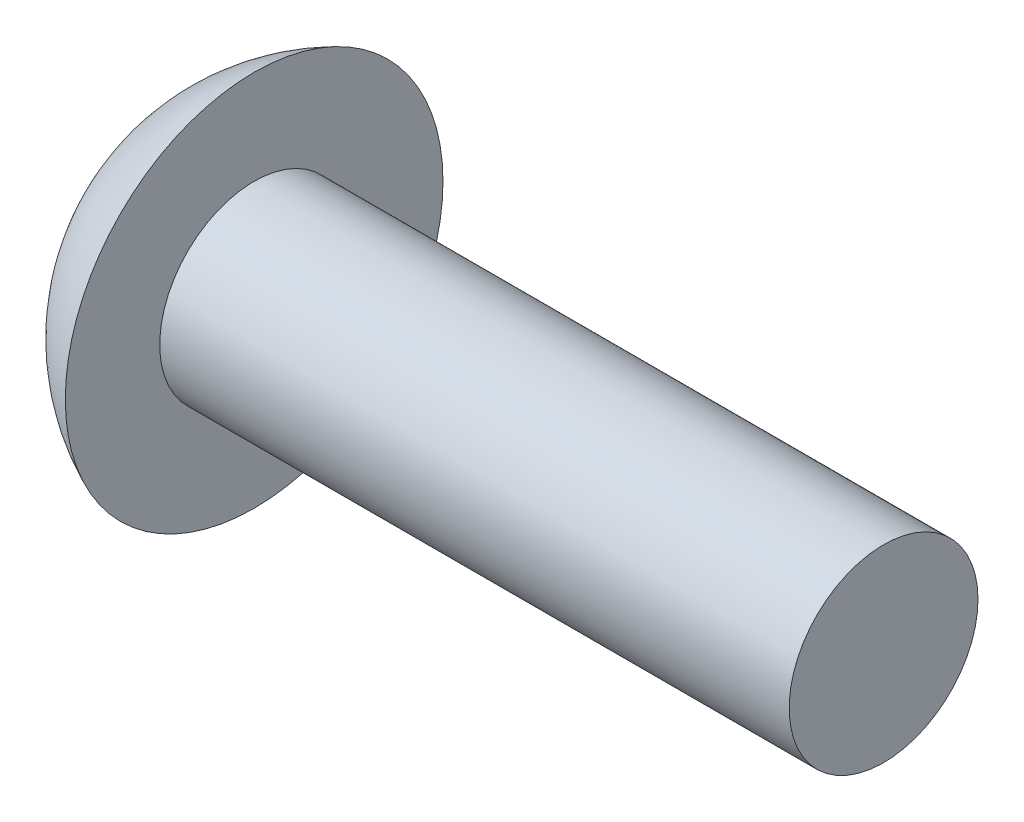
ISO-10303-21;
HEADER;
FILE_DESCRIPTION(('STEP AP214'),'2;1');
FILE_NAME('part.step','',(''),(''),'','','');
FILE_SCHEMA(('AUTOMOTIVE_DESIGN { 1 0 10303 214 1 1 1 1 }'));
ENDSEC;
DATA;
#1=APPLICATION_CONTEXT('core data for automotive mechanical design processes');
#2=APPLICATION_PROTOCOL_DEFINITION('international standard','automotive_design',2000,#1);
#3=PRODUCT_CONTEXT('',#1,'mechanical');
#4=PRODUCT('Part','Part','',(#3));
#5=PRODUCT_RELATED_PRODUCT_CATEGORY('part','',(#4));
#6=PRODUCT_DEFINITION_FORMATION('','',#4);
#7=PRODUCT_DEFINITION_CONTEXT('part definition',#1,'design');
#8=PRODUCT_DEFINITION('design','',#6,#7);
#9=PRODUCT_DEFINITION_SHAPE('','',#8);
#10=(LENGTH_UNIT() NAMED_UNIT(*) SI_UNIT(.MILLI.,.METRE.));
#11=(NAMED_UNIT(*) PLANE_ANGLE_UNIT() SI_UNIT($,.RADIAN.));
#12=(NAMED_UNIT(*) SI_UNIT($,.STERADIAN.) SOLID_ANGLE_UNIT());
#13=UNCERTAINTY_MEASURE_WITH_UNIT(LENGTH_MEASURE(1.E-05),#10,'distance_accuracy_value','');
#14=(GEOMETRIC_REPRESENTATION_CONTEXT(3) GLOBAL_UNCERTAINTY_ASSIGNED_CONTEXT((#13)) GLOBAL_UNIT_ASSIGNED_CONTEXT((#10,
#11,#12)) REPRESENTATION_CONTEXT('',''));
#15=CARTESIAN_POINT('',(0.,0.,0.));
#16=DIRECTION('',(0.,0.,1.));
#17=DIRECTION('',(1.,0.,0.));
#18=AXIS2_PLACEMENT_3D('',#15,#16,#17);
#19=CARTESIAN_POINT('',(0.,0.,0.));
#20=DIRECTION('',(1.,0.,0.));
#21=DIRECTION('',(0.,0.,-1.));
#22=AXIS2_PLACEMENT_3D('',#19,#20,#21);
#23=PLANE('',#22);
#24=CARTESIAN_POINT('',(0.,0.,0.));
#25=DIRECTION('',(-1.,0.,0.));
#26=DIRECTION('',(0.,0.,1.));
#27=AXIS2_PLACEMENT_3D('',#24,#25,#26);
#28=CIRCLE('',#27,2.75);
#29=CARTESIAN_POINT('',(0.,2.75,0.));
#30=VERTEX_POINT('',#29);
#31=EDGE_CURVE('E132',#30,#30,#28,.T.);
#32=ORIENTED_EDGE('',*,*,#31,.T.);
#33=EDGE_LOOP('',(#32));
#34=FACE_BOUND('',#33,.T.);
#35=DIRECTION('',(0.,0.866025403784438,-0.5));
#36=VECTOR('',#35,1.);
#37=CARTESIAN_POINT('',(0.,-2.,-1.15470053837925));
#38=LINE('',#37,#36);
#39=CARTESIAN_POINT('',(0.,-2.,-1.15470053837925));
#40=VERTEX_POINT('',#39);
#41=CARTESIAN_POINT('',(0.,0.,-2.3094010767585));
#42=VERTEX_POINT('',#41);
#43=EDGE_CURVE('E60',#40,#42,#38,.T.);
#44=ORIENTED_EDGE('',*,*,#43,.T.);
#45=DIRECTION('',(0.,0.866025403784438,0.5));
#46=VECTOR('',#45,1.);
#47=CARTESIAN_POINT('',(0.,0.,-2.3094010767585));
#48=LINE('',#47,#46);
#49=CARTESIAN_POINT('',(0.,2.,-1.15470053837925));
#50=VERTEX_POINT('',#49);
#51=EDGE_CURVE('E116',#42,#50,#48,.T.);
#52=ORIENTED_EDGE('',*,*,#51,.T.);
#53=DIRECTION('',(0.,0.,1.));
#54=VECTOR('',#53,1.);
#55=CARTESIAN_POINT('',(0.,2.,-1.15470053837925));
#56=LINE('',#55,#54);
#57=CARTESIAN_POINT('',(0.,2.,1.15470053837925));
#58=VERTEX_POINT('',#57);
#59=EDGE_CURVE('E112',#50,#58,#56,.T.);
#60=ORIENTED_EDGE('',*,*,#59,.T.);
#61=DIRECTION('',(0.,-0.866025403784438,0.5));
#62=VECTOR('',#61,1.);
#63=CARTESIAN_POINT('',(0.,2.,1.15470053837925));
#64=LINE('',#63,#62);
#65=CARTESIAN_POINT('',(0.,0.,2.3094010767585));
#66=VERTEX_POINT('',#65);
#67=EDGE_CURVE('E93',#58,#66,#64,.T.);
#68=ORIENTED_EDGE('',*,*,#67,.T.);
#69=DIRECTION('',(0.,-0.866025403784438,-0.5));
#70=VECTOR('',#69,1.);
#71=CARTESIAN_POINT('',(0.,0.,2.3094010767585));
#72=LINE('',#71,#70);
#73=CARTESIAN_POINT('',(0.,-2.,1.15470053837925));
#74=VERTEX_POINT('',#73);
#75=EDGE_CURVE('E104',#66,#74,#72,.T.);
#76=ORIENTED_EDGE('',*,*,#75,.T.);
#77=DIRECTION('',(0.,0.,-1.));
#78=VECTOR('',#77,1.);
#79=CARTESIAN_POINT('',(0.,-2.,1.15470053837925));
#80=LINE('',#79,#78);
#81=EDGE_CURVE('E109',#74,#40,#80,.T.);
#82=ORIENTED_EDGE('',*,*,#81,.T.);
#83=EDGE_LOOP('',(#44,#52,#60,#68,#76,#82));
#84=FACE_BOUND('',#83,.T.);
#85=ADVANCED_FACE('F43',(#34,#84),#23,.F.);
#86=CARTESIAN_POINT('',(3.3,0.,0.));
#87=DIRECTION('',(1.,0.,0.));
#88=DIRECTION('',(0.,0.,-1.));
#89=AXIS2_PLACEMENT_3D('',#86,#87,#88);
#90=PLANE('',#89);
#91=CARTESIAN_POINT('',(3.3,0.,0.));
#92=DIRECTION('',(-1.,0.,0.));
#93=DIRECTION('',(0.,0.,1.));
#94=AXIS2_PLACEMENT_3D('',#91,#92,#93);
#95=CIRCLE('',#94,6.);
#96=CARTESIAN_POINT('',(3.3,6.,0.));
#97=VERTEX_POINT('',#96);
#98=EDGE_CURVE('E131',#97,#97,#95,.T.);
#99=ORIENTED_EDGE('',*,*,#98,.F.);
#100=EDGE_LOOP('',(#99));
#101=FACE_BOUND('',#100,.T.);
#102=CARTESIAN_POINT('',(3.3,0.,0.));
#103=DIRECTION('',(1.,0.,0.));
#104=DIRECTION('',(0.,0.,-1.));
#105=AXIS2_PLACEMENT_3D('',#102,#103,#104);
#106=CIRCLE('',#105,3.);
#107=CARTESIAN_POINT('',(3.3,0.,-3.));
#108=VERTEX_POINT('',#107);
#109=EDGE_CURVE('E46',#108,#108,#106,.T.);
#110=ORIENTED_EDGE('',*,*,#109,.F.);
#111=EDGE_LOOP('',(#110));
#112=FACE_BOUND('',#111,.T.);
#113=ADVANCED_FACE('F147',(#101,#112),#90,.T.);
#114=CARTESIAN_POINT('',(23.3,0.,0.));
#115=DIRECTION('',(-1.,0.,0.));
#116=DIRECTION('',(0.,0.,1.));
#117=AXIS2_PLACEMENT_3D('',#114,#115,#116);
#118=CYLINDRICAL_SURFACE('',#117,3.);
#119=CARTESIAN_POINT('',(23.3,0.,0.));
#120=DIRECTION('',(1.,0.,0.));
#121=DIRECTION('',(0.,0.,-1.));
#122=AXIS2_PLACEMENT_3D('',#119,#120,#121);
#123=CIRCLE('',#122,3.);
#124=CARTESIAN_POINT('',(23.3,0.,-3.));
#125=VERTEX_POINT('',#124);
#126=EDGE_CURVE('E11',#125,#125,#123,.T.);
#127=ORIENTED_EDGE('',*,*,#126,.F.);
#128=EDGE_LOOP('',(#127));
#129=FACE_BOUND('',#128,.T.);
#130=ORIENTED_EDGE('',*,*,#109,.T.);
#131=EDGE_LOOP('',(#130));
#132=FACE_BOUND('',#131,.T.);
#133=ADVANCED_FACE('F144',(#129,#132),#118,.T.);
#134=CARTESIAN_POINT('',(23.3,0.,0.));
#135=DIRECTION('',(1.,0.,0.));
#136=DIRECTION('',(0.,0.,-1.));
#137=AXIS2_PLACEMENT_3D('',#134,#135,#136);
#138=PLANE('',#137);
#139=ORIENTED_EDGE('',*,*,#126,.T.);
#140=EDGE_LOOP('',(#139));
#141=FACE_BOUND('',#140,.T.);
#142=ADVANCED_FACE('F152',(#141),#138,.T.);
#143=CARTESIAN_POINT('',(5.95871212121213,0.,0.));
#144=DIRECTION('',(-1.,0.,0.));
#145=DIRECTION('',(0.,1.,0.));
#146=AXIS2_PLACEMENT_3D('',#143,#144,#145);
#147=SPHERICAL_SURFACE('',#146,6.56267857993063);
#148=CARTESIAN_POINT('',(3.3,6.,0.));
#149=CARTESIAN_POINT('',(3.2549189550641,5.9800238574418,0.));
#150=CARTESIAN_POINT('',(3.21006313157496,5.95953946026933,0.));
#151=CARTESIAN_POINT('',(3.12082452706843,5.91756496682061,0.));
#152=CARTESIAN_POINT('',(3.07644174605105,5.89607487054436,0.));
#153=CARTESIAN_POINT('',(2.98817182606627,5.85209978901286,0.));
#154=CARTESIAN_POINT('',(2.94428468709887,5.82961480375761,0.));
#155=CARTESIAN_POINT('',(2.85702833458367,5.78366139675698,0.));
#156=CARTESIAN_POINT('',(2.81365912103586,5.76019297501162,0.));
#157=CARTESIAN_POINT('',(2.72746065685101,5.71228461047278,0.));
#158=CARTESIAN_POINT('',(2.68463140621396,5.68784466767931,0.));
#159=CARTESIAN_POINT('',(2.59953462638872,5.63800567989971,0.));
#160=CARTESIAN_POINT('',(2.55726709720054,5.61260663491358,0.));
#161=CARTESIAN_POINT('',(2.47331523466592,5.56086234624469,0.));
#162=CARTESIAN_POINT('',(2.43163090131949,5.53451710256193,0.));
#163=CARTESIAN_POINT('',(2.3488666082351,5.48089380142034,0.));
#164=CARTESIAN_POINT('',(2.30778664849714,5.45361574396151,0.));
#165=CARTESIAN_POINT('',(2.22625197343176,5.39814067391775,0.));
#166=CARTESIAN_POINT('',(2.18579725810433,5.36994366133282,0.));
#167=CARTESIAN_POINT('',(2.10553362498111,5.31264500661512,0.));
#168=CARTESIAN_POINT('',(2.06572470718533,5.28354336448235,0.));
#169=CARTESIAN_POINT('',(1.98677289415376,5.22445023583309,0.));
#170=CARTESIAN_POINT('',(1.94762999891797,5.1944587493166,0.));
#171=CARTESIAN_POINT('',(1.87003011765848,5.13360116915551,0.));
#172=CARTESIAN_POINT('',(1.83157313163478,5.10273507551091,0.));
#173=CARTESIAN_POINT('',(1.75536460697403,5.04014396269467,0.));
#174=CARTESIAN_POINT('',(1.71761306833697,5.00841894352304,0.));
#175=CARTESIAN_POINT('',(1.64283461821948,4.94412609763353,0.));
#176=CARTESIAN_POINT('',(1.60580770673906,4.91155827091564,0.));
#177=CARTESIAN_POINT('',(1.53249732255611,4.84559635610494,0.));
#178=CARTESIAN_POINT('',(1.49621384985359,4.81220226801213,0.));
#179=CARTESIAN_POINT('',(1.42440877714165,4.7446047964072,0.));
#180=CARTESIAN_POINT('',(1.38888717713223,4.7104014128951,0.));
#181=CARTESIAN_POINT('',(1.31862389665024,4.64120272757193,0.));
#182=CARTESIAN_POINT('',(1.28388221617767,4.60620742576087,0.));
#183=CARTESIAN_POINT('',(1.21519642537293,4.53544268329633,0.));
#184=CARTESIAN_POINT('',(1.18125231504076,4.49967324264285,0.));
#185=CARTESIAN_POINT('',(1.11417890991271,4.42737839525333,0.));
#186=CARTESIAN_POINT('',(1.08104961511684,4.39085298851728,0.));
#187=CARTESIAN_POINT('',(1.01562267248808,4.31706476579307,0.));
#188=CARTESIAN_POINT('',(0.983325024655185,4.2798019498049,0.));
#189=CARTESIAN_POINT('',(0.919577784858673,4.20455784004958,0.));
#190=CARTESIAN_POINT('',(0.888128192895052,4.16657654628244,0.));
#191=CARTESIAN_POINT('',(0.826093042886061,4.089914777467,0.));
#192=CARTESIAN_POINT('',(0.795507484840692,4.0512343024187,0.));
#193=CARTESIAN_POINT('',(0.735215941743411,3.97319382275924,0.));
#194=CARTESIAN_POINT('',(0.7055099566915,3.93383381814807,0.));
#195=CARTESIAN_POINT('',(0.646992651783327,3.85445427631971,0.));
#196=CARTESIAN_POINT('',(0.618181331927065,3.81443473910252,0.));
#197=CARTESIAN_POINT('',(0.561467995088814,3.73375646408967,0.));
#198=CARTESIAN_POINT('',(0.533565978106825,3.69309772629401,0.));
#199=CARTESIAN_POINT('',(0.47868542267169,3.61116170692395,0.));
#200=CARTESIAN_POINT('',(0.451706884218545,3.56988442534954,0.));
#201=CARTESIAN_POINT('',(0.39868699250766,3.48673228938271,0.));
#202=CARTESIAN_POINT('',(0.372645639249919,3.44485743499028,0.));
#203=CARTESIAN_POINT('',(0.321513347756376,3.36053142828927,0.));
#204=CARTESIAN_POINT('',(0.296422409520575,3.31808027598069,0.));
#205=CARTESIAN_POINT('',(0.247203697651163,3.23262323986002,0.));
#206=CARTESIAN_POINT('',(0.223075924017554,3.18961735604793,0.));
#207=CARTESIAN_POINT('',(0.175795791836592,3.10307270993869,0.));
#208=CARTESIAN_POINT('',(0.152643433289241,3.05953394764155,0.));
#209=CARTESIAN_POINT('',(0.107325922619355,2.971945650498,0.));
#210=CARTESIAN_POINT('',(0.0851607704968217,2.9278961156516,0.));
#211=CARTESIAN_POINT('',(0.0418288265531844,2.83930870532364,0.));
#212=CARTESIAN_POINT('',(0.0206620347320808,2.79477082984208,0.));
#213=CARTESIAN_POINT('',(0.,2.75,0.));
#214=B_SPLINE_CURVE_WITH_KNOTS('',3,(#148,#149,#150,#151,#152,#153,#154,#155,#156,#157,#158,
#159,#160,#161,#162,#163,#164,#165,#166,#167,#168,#169,#170,#171,#172,#173,#174,#175,#176,#177,
#178,#179,#180,#181,#182,#183,#184,#185,#186,#187,#188,#189,#190,#191,#192,#193,#194,#195,#196,
#197,#198,#199,#200,#201,#202,#203,#204,#205,#206,#207,#208,#209,#210,#211,#212,#213),
.UNSPECIFIED.,.F.,.F.,(4,2,2,2,2,2,2,2,2,2,2,2,2,2,2,2,2,2,2,2,2,2,2,2,2,2,2,2,2,2,2,2,4),(0.,
0.147922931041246,0.295845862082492,0.443768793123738,0.591691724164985,0.73961465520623,
0.887537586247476,1.03546051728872,1.18338344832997,1.33130637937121,1.47922931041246,
1.62715224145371,1.77507517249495,1.9229981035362,2.07092103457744,2.21884396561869,
2.36676689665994,2.51468982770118,2.66261275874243,2.81053568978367,2.95845862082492,
3.10638155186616,3.25430448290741,3.40222741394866,3.5501503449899,3.69807327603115,
3.84599620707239,3.99391913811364,4.14184206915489,4.28976500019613,4.43768793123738,
4.58561086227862,4.73353379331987),.UNSPECIFIED.);
#215=EDGE_CURVE('BSEAM157',#97,#30,#214,.T.);
#216=ORIENTED_EDGE('',*,*,#98,.T.);
#217=ORIENTED_EDGE('',*,*,#31,.F.);
#218=ORIENTED_EDGE('',*,*,#215,.T.);
#219=ORIENTED_EDGE('',*,*,#215,.F.);
#220=EDGE_LOOP('',(#216,#218,#217,#219));
#221=FACE_BOUND('',#220,.T.);
#222=ADVANCED_FACE('F157',(#221),#147,.T.);
#223=CARTESIAN_POINT('',(2.08,-2.,-1.15470053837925));
#224=DIRECTION('',(0.,0.5,0.866025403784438));
#225=DIRECTION('',(0.,-0.866025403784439,0.5));
#226=AXIS2_PLACEMENT_3D('',#223,#224,#225);
#227=PLANE('',#226);
#228=ORIENTED_EDGE('',*,*,#43,.F.);
#229=DIRECTION('',(-1.,0.,0.));
#230=VECTOR('',#229,1.);
#231=CARTESIAN_POINT('',(2.08,-2.,-1.15470053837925));
#232=LINE('',#231,#230);
#233=CARTESIAN_POINT('',(2.08,-2.,-1.15470053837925));
#234=VERTEX_POINT('',#233);
#235=EDGE_CURVE('E125',#234,#40,#232,.T.);
#236=ORIENTED_EDGE('',*,*,#235,.F.);
#237=DIRECTION('',(0.,0.866025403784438,-0.5));
#238=VECTOR('',#237,1.);
#239=CARTESIAN_POINT('',(2.08,-2.,-1.15470053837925));
#240=LINE('',#239,#238);
#241=CARTESIAN_POINT('',(2.08,0.,-2.3094010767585));
#242=VERTEX_POINT('',#241);
#243=EDGE_CURVE('E122',#234,#242,#240,.T.);
#244=ORIENTED_EDGE('',*,*,#243,.T.);
#245=DIRECTION('',(-1.,0.,0.));
#246=VECTOR('',#245,1.);
#247=CARTESIAN_POINT('',(2.08,0.,-2.3094010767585));
#248=LINE('',#247,#246);
#249=EDGE_CURVE('E126',#242,#42,#248,.T.);
#250=ORIENTED_EDGE('',*,*,#249,.T.);
#251=EDGE_LOOP('',(#228,#236,#244,#250));
#252=FACE_BOUND('',#251,.T.);
#253=ADVANCED_FACE('F161',(#252),#227,.T.);
#254=CARTESIAN_POINT('',(2.08,0.,-2.3094010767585));
#255=DIRECTION('',(0.,-0.5,0.866025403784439));
#256=DIRECTION('',(0.,-0.866025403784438,-0.5));
#257=AXIS2_PLACEMENT_3D('',#254,#255,#256);
#258=PLANE('',#257);
#259=ORIENTED_EDGE('',*,*,#51,.F.);
#260=ORIENTED_EDGE('',*,*,#249,.F.);
#261=DIRECTION('',(0.,0.866025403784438,0.5));
#262=VECTOR('',#261,1.);
#263=CARTESIAN_POINT('',(2.08,0.,-2.3094010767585));
#264=LINE('',#263,#262);
#265=CARTESIAN_POINT('',(2.08,2.,-1.15470053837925));
#266=VERTEX_POINT('',#265);
#267=EDGE_CURVE('E234',#242,#266,#264,.T.);
#268=ORIENTED_EDGE('',*,*,#267,.T.);
#269=DIRECTION('',(-1.,0.,0.));
#270=VECTOR('',#269,1.);
#271=CARTESIAN_POINT('',(2.08,2.,-1.15470053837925));
#272=LINE('',#271,#270);
#273=EDGE_CURVE('E129',#266,#50,#272,.T.);
#274=ORIENTED_EDGE('',*,*,#273,.T.);
#275=EDGE_LOOP('',(#259,#260,#268,#274));
#276=FACE_BOUND('',#275,.T.);
#277=ADVANCED_FACE('F168',(#276),#258,.T.);
#278=CARTESIAN_POINT('',(2.08,2.,-1.15470053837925));
#279=DIRECTION('',(0.,-1.,0.));
#280=DIRECTION('',(0.,0.,-1.));
#281=AXIS2_PLACEMENT_3D('',#278,#279,#280);
#282=PLANE('',#281);
#283=ORIENTED_EDGE('',*,*,#59,.F.);
#284=ORIENTED_EDGE('',*,*,#273,.F.);
#285=DIRECTION('',(0.,0.,1.));
#286=VECTOR('',#285,1.);
#287=CARTESIAN_POINT('',(2.08,2.,-1.15470053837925));
#288=LINE('',#287,#286);
#289=CARTESIAN_POINT('',(2.08,2.,1.15470053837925));
#290=VERTEX_POINT('',#289);
#291=EDGE_CURVE('E67',#266,#290,#288,.T.);
#292=ORIENTED_EDGE('',*,*,#291,.T.);
#293=DIRECTION('',(-1.,0.,0.));
#294=VECTOR('',#293,1.);
#295=CARTESIAN_POINT('',(2.08,2.,1.15470053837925));
#296=LINE('',#295,#294);
#297=EDGE_CURVE('E99',#290,#58,#296,.T.);
#298=ORIENTED_EDGE('',*,*,#297,.T.);
#299=EDGE_LOOP('',(#283,#284,#292,#298));
#300=FACE_BOUND('',#299,.T.);
#301=ADVANCED_FACE('F169',(#300),#282,.T.);
#302=CARTESIAN_POINT('',(2.08,2.,1.15470053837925));
#303=DIRECTION('',(0.,-0.5,-0.866025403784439));
#304=DIRECTION('',(0.,0.866025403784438,-0.5));
#305=AXIS2_PLACEMENT_3D('',#302,#303,#304);
#306=PLANE('',#305);
#307=ORIENTED_EDGE('',*,*,#67,.F.);
#308=ORIENTED_EDGE('',*,*,#297,.F.);
#309=DIRECTION('',(0.,-0.866025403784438,0.5));
#310=VECTOR('',#309,1.);
#311=CARTESIAN_POINT('',(2.08,2.,1.15470053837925));
#312=LINE('',#311,#310);
#313=CARTESIAN_POINT('',(2.08,0.,2.3094010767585));
#314=VERTEX_POINT('',#313);
#315=EDGE_CURVE('E97',#290,#314,#312,.T.);
#316=ORIENTED_EDGE('',*,*,#315,.T.);
#317=DIRECTION('',(-1.,0.,0.));
#318=VECTOR('',#317,1.);
#319=CARTESIAN_POINT('',(2.08,0.,2.3094010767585));
#320=LINE('',#319,#318);
#321=EDGE_CURVE('E90',#314,#66,#320,.T.);
#322=ORIENTED_EDGE('',*,*,#321,.T.);
#323=EDGE_LOOP('',(#307,#308,#316,#322));
#324=FACE_BOUND('',#323,.T.);
#325=ADVANCED_FACE('F88',(#324),#306,.T.);
#326=CARTESIAN_POINT('',(2.08,0.,2.3094010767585));
#327=DIRECTION('',(0.,0.5,-0.866025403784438));
#328=DIRECTION('',(0.,0.866025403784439,0.5));
#329=AXIS2_PLACEMENT_3D('',#326,#327,#328);
#330=PLANE('',#329);
#331=ORIENTED_EDGE('',*,*,#75,.F.);
#332=ORIENTED_EDGE('',*,*,#321,.F.);
#333=DIRECTION('',(0.,-0.866025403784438,-0.5));
#334=VECTOR('',#333,1.);
#335=CARTESIAN_POINT('',(2.08,0.,2.3094010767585));
#336=LINE('',#335,#334);
#337=CARTESIAN_POINT('',(2.08,-2.,1.15470053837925));
#338=VERTEX_POINT('',#337);
#339=EDGE_CURVE('E209',#314,#338,#336,.T.);
#340=ORIENTED_EDGE('',*,*,#339,.T.);
#341=DIRECTION('',(-1.,0.,0.));
#342=VECTOR('',#341,1.);
#343=CARTESIAN_POINT('',(2.08,-2.,1.15470053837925));
#344=LINE('',#343,#342);
#345=EDGE_CURVE('E103',#338,#74,#344,.T.);
#346=ORIENTED_EDGE('',*,*,#345,.T.);
#347=EDGE_LOOP('',(#331,#332,#340,#346));
#348=FACE_BOUND('',#347,.T.);
#349=ADVANCED_FACE('F102',(#348),#330,.T.);
#350=CARTESIAN_POINT('',(2.08,-2.,1.15470053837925));
#351=DIRECTION('',(0.,1.,0.));
#352=DIRECTION('',(0.,0.,1.));
#353=AXIS2_PLACEMENT_3D('',#350,#351,#352);
#354=PLANE('',#353);
#355=ORIENTED_EDGE('',*,*,#81,.F.);
#356=ORIENTED_EDGE('',*,*,#345,.F.);
#357=DIRECTION('',(0.,0.,-1.));
#358=VECTOR('',#357,1.);
#359=CARTESIAN_POINT('',(2.08,-2.,1.15470053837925));
#360=LINE('',#359,#358);
#361=EDGE_CURVE('E121',#338,#234,#360,.T.);
#362=ORIENTED_EDGE('',*,*,#361,.T.);
#363=ORIENTED_EDGE('',*,*,#235,.T.);
#364=EDGE_LOOP('',(#355,#356,#362,#363));
#365=FACE_BOUND('',#364,.T.);
#366=ADVANCED_FACE('F178',(#365),#354,.T.);
#367=CARTESIAN_POINT('',(2.08,0.,2.3094010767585));
#368=DIRECTION('',(0.86602540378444,-0.249999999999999,0.433012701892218));
#369=DIRECTION('',(0.447213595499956,0.,-0.894427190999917));
#370=AXIS2_PLACEMENT_3D('',#367,#368,#369);
#371=PLANE('',#370);
#372=ORIENTED_EDGE('',*,*,#339,.F.);
#373=DIRECTION('',(-0.447213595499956,0.,0.894427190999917));
#374=VECTOR('',#373,1.);
#375=CARTESIAN_POINT('',(2.08,0.,2.3094010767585));
#376=LINE('',#375,#374);
#377=CARTESIAN_POINT('',(3.23470053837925,0.,0.));
#378=VERTEX_POINT('',#377);
#379=EDGE_CURVE('E212',#378,#314,#376,.T.);
#380=ORIENTED_EDGE('',*,*,#379,.F.);
#381=DIRECTION('',(-0.447213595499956,-0.774596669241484,0.447213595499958));
#382=VECTOR('',#381,1.);
#383=CARTESIAN_POINT('',(2.08,-2.,1.15470053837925));
#384=LINE('',#383,#382);
#385=EDGE_CURVE('E211',#378,#338,#384,.T.);
#386=ORIENTED_EDGE('',*,*,#385,.T.);
#387=EDGE_LOOP('',(#372,#380,#386));
#388=FACE_BOUND('',#387,.T.);
#389=ADVANCED_FACE('F181',(#388),#371,.F.);
#390=CARTESIAN_POINT('',(2.08,-2.,1.15470053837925));
#391=DIRECTION('',(0.86602540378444,-0.499999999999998,0.));
#392=DIRECTION('',(0.499999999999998,0.86602540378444,0.));
#393=AXIS2_PLACEMENT_3D('',#390,#391,#392);
#394=PLANE('',#393);
#395=ORIENTED_EDGE('',*,*,#361,.F.);
#396=ORIENTED_EDGE('',*,*,#385,.F.);
#397=DIRECTION('',(-0.447213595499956,-0.774596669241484,-0.447213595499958));
#398=VECTOR('',#397,1.);
#399=CARTESIAN_POINT('',(2.08,-2.,-1.15470053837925));
#400=LINE('',#399,#398);
#401=EDGE_CURVE('E238',#378,#234,#400,.T.);
#402=ORIENTED_EDGE('',*,*,#401,.T.);
#403=EDGE_LOOP('',(#395,#396,#402));
#404=FACE_BOUND('',#403,.T.);
#405=ADVANCED_FACE('F182',(#404),#394,.F.);
#406=CARTESIAN_POINT('',(2.08,-2.,-1.15470053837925));
#407=DIRECTION('',(0.86602540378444,-0.249999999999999,-0.433012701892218));
#408=DIRECTION('',(-0.447213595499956,0.,-0.894427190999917));
#409=AXIS2_PLACEMENT_3D('',#406,#407,#408);
#410=PLANE('',#409);
#411=ORIENTED_EDGE('',*,*,#243,.F.);
#412=ORIENTED_EDGE('',*,*,#401,.F.);
#413=DIRECTION('',(-0.447213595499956,0.,-0.894427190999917));
#414=VECTOR('',#413,1.);
#415=CARTESIAN_POINT('',(2.08,0.,-2.3094010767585));
#416=LINE('',#415,#414);
#417=EDGE_CURVE('E246',#378,#242,#416,.T.);
#418=ORIENTED_EDGE('',*,*,#417,.T.);
#419=EDGE_LOOP('',(#411,#412,#418));
#420=FACE_BOUND('',#419,.T.);
#421=ADVANCED_FACE('F187',(#420),#410,.F.);
#422=CARTESIAN_POINT('',(2.08,0.,-2.3094010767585));
#423=DIRECTION('',(0.86602540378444,0.249999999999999,-0.433012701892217));
#424=DIRECTION('',(-0.447213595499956,0.,-0.894427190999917));
#425=AXIS2_PLACEMENT_3D('',#422,#423,#424);
#426=PLANE('',#425);
#427=ORIENTED_EDGE('',*,*,#267,.F.);
#428=ORIENTED_EDGE('',*,*,#417,.F.);
#429=DIRECTION('',(-0.447213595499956,0.774596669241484,-0.447213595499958));
#430=VECTOR('',#429,1.);
#431=CARTESIAN_POINT('',(2.08,2.,-1.15470053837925));
#432=LINE('',#431,#430);
#433=EDGE_CURVE('E247',#378,#266,#432,.T.);
#434=ORIENTED_EDGE('',*,*,#433,.T.);
#435=EDGE_LOOP('',(#427,#428,#434));
#436=FACE_BOUND('',#435,.T.);
#437=ADVANCED_FACE('F188',(#436),#426,.F.);
#438=CARTESIAN_POINT('',(2.08,2.,-1.15470053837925));
#439=DIRECTION('',(0.86602540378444,0.499999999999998,0.));
#440=DIRECTION('',(-0.499999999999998,0.86602540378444,0.));
#441=AXIS2_PLACEMENT_3D('',#438,#439,#440);
#442=PLANE('',#441);
#443=ORIENTED_EDGE('',*,*,#291,.F.);
#444=ORIENTED_EDGE('',*,*,#433,.F.);
#445=DIRECTION('',(-0.447213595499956,0.774596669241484,0.447213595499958));
#446=VECTOR('',#445,1.);
#447=CARTESIAN_POINT('',(2.08,2.,1.15470053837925));
#448=LINE('',#447,#446);
#449=EDGE_CURVE('E245',#378,#290,#448,.T.);
#450=ORIENTED_EDGE('',*,*,#449,.T.);
#451=EDGE_LOOP('',(#443,#444,#450));
#452=FACE_BOUND('',#451,.T.);
#453=ADVANCED_FACE('F191',(#452),#442,.F.);
#454=CARTESIAN_POINT('',(2.08,2.,1.15470053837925));
#455=DIRECTION('',(0.86602540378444,0.249999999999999,0.433012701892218));
#456=DIRECTION('',(0.447213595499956,0.,-0.894427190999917));
#457=AXIS2_PLACEMENT_3D('',#454,#455,#456);
#458=PLANE('',#457);
#459=ORIENTED_EDGE('',*,*,#315,.F.);
#460=ORIENTED_EDGE('',*,*,#449,.F.);
#461=ORIENTED_EDGE('',*,*,#379,.T.);
#462=EDGE_LOOP('',(#459,#460,#461));
#463=FACE_BOUND('',#462,.T.);
#464=ADVANCED_FACE('F200',(#463),#458,.F.);
#465=CLOSED_SHELL('',(#85,#113,#133,#142,#222,#253,#277,#301,#325,#349,#366,#389,#405,#421,#437,
#453,#464));
#466=MANIFOLD_SOLID_BREP('B2',#465);
#467=ADVANCED_BREP_SHAPE_REPRESENTATION('',(#18,#466),#14);
#468=SHAPE_DEFINITION_REPRESENTATION(#9,#467);
ENDSEC;
END-ISO-10303-21;
